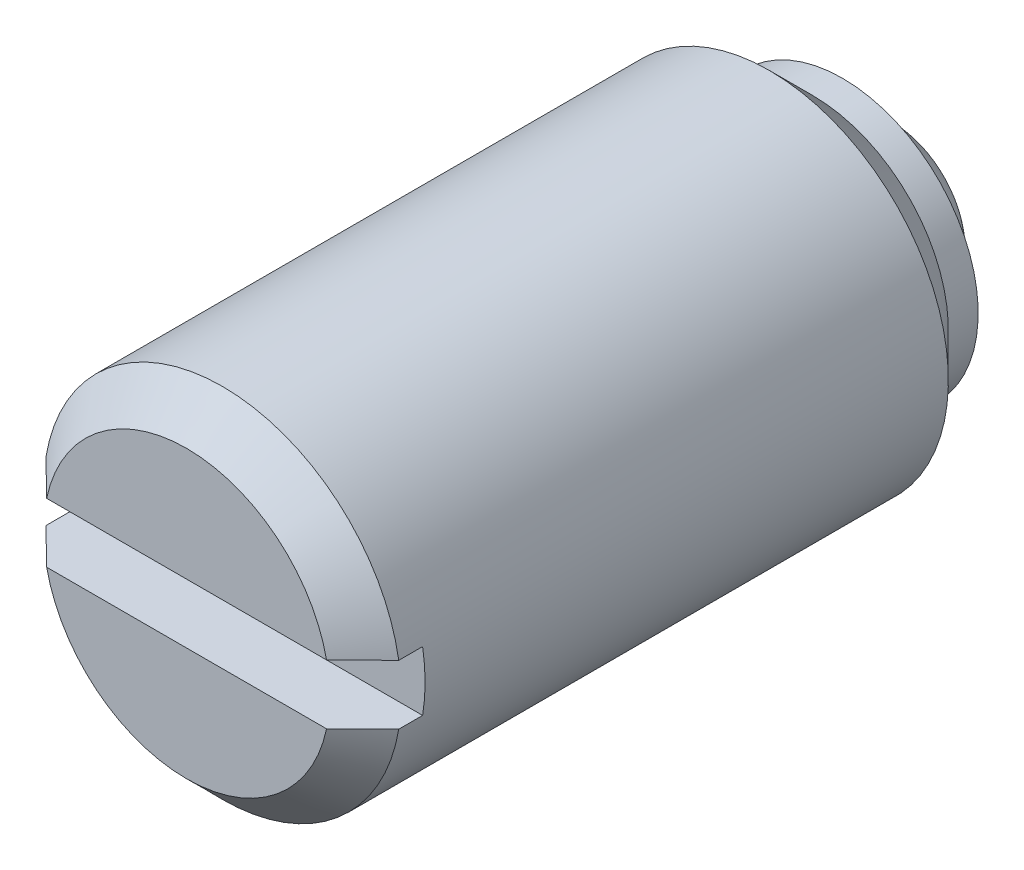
ISO-10303-21;
HEADER;
FILE_DESCRIPTION(('STEP AP214'),'2;1');
FILE_NAME('part.step','',(''),(''),'','','');
FILE_SCHEMA(('AUTOMOTIVE_DESIGN { 1 0 10303 214 1 1 1 1 }'));
ENDSEC;
DATA;
#1=APPLICATION_CONTEXT('core data for automotive mechanical design processes');
#2=APPLICATION_PROTOCOL_DEFINITION('international standard','automotive_design',2000,#1);
#3=PRODUCT_CONTEXT('',#1,'mechanical');
#4=PRODUCT('Part','Part','',(#3));
#5=PRODUCT_RELATED_PRODUCT_CATEGORY('part','',(#4));
#6=PRODUCT_DEFINITION_FORMATION('','',#4);
#7=PRODUCT_DEFINITION_CONTEXT('part definition',#1,'design');
#8=PRODUCT_DEFINITION('design','',#6,#7);
#9=PRODUCT_DEFINITION_SHAPE('','',#8);
#10=(LENGTH_UNIT() NAMED_UNIT(*) SI_UNIT(.MILLI.,.METRE.));
#11=(NAMED_UNIT(*) PLANE_ANGLE_UNIT() SI_UNIT($,.RADIAN.));
#12=(NAMED_UNIT(*) SI_UNIT($,.STERADIAN.) SOLID_ANGLE_UNIT());
#13=UNCERTAINTY_MEASURE_WITH_UNIT(LENGTH_MEASURE(1.E-05),#10,'distance_accuracy_value','');
#14=(GEOMETRIC_REPRESENTATION_CONTEXT(3) GLOBAL_UNCERTAINTY_ASSIGNED_CONTEXT((#13)) GLOBAL_UNIT_ASSIGNED_CONTEXT((#10,
#11,#12)) REPRESENTATION_CONTEXT('',''));
#15=CARTESIAN_POINT('',(0.,0.,0.));
#16=DIRECTION('',(0.,0.,1.));
#17=DIRECTION('',(1.,0.,0.));
#18=AXIS2_PLACEMENT_3D('',#15,#16,#17);
#19=CARTESIAN_POINT('',(0.,6.,24.5));
#20=DIRECTION('',(0.,0.,1.));
#21=DIRECTION('',(1.,0.,0.));
#22=AXIS2_PLACEMENT_3D('',#19,#20,#21);
#23=PLANE('',#22);
#24=CARTESIAN_POINT('',(0.,0.,24.5));
#25=DIRECTION('',(0.,0.,-1.));
#26=DIRECTION('',(0.,1.,0.));
#27=AXIS2_PLACEMENT_3D('',#24,#25,#26);
#28=CIRCLE('',#27,4.8);
#29=CARTESIAN_POINT('',(-4.6946778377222,1.,24.5));
#30=VERTEX_POINT('',#29);
#31=CARTESIAN_POINT('',(4.6946778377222,1.,24.5));
#32=VERTEX_POINT('',#31);
#33=EDGE_CURVE('E35',#30,#32,#28,.T.);
#34=ORIENTED_EDGE('',*,*,#33,.F.);
#35=DIRECTION('',(1.,0.,0.));
#36=VECTOR('',#35,1.);
#37=CARTESIAN_POINT('',(-5.91607978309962,1.,24.5));
#38=LINE('',#37,#36);
#39=EDGE_CURVE('E124',#30,#32,#38,.T.);
#40=ORIENTED_EDGE('',*,*,#39,.T.);
#41=EDGE_LOOP('',(#34,#40));
#42=FACE_BOUND('',#41,.T.);
#43=ADVANCED_FACE('F14',(#42),#23,.T.);
#44=CARTESIAN_POINT('',(0.,0.,-5.5));
#45=DIRECTION('',(0.,0.,-1.));
#46=DIRECTION('',(-1.,0.,0.));
#47=AXIS2_PLACEMENT_3D('',#44,#45,#46);
#48=CYLINDRICAL_SURFACE('',#47,6.);
#49=CARTESIAN_POINT('',(0.,0.,23.3));
#50=DIRECTION('',(0.,0.,-1.));
#51=DIRECTION('',(0.,1.,0.));
#52=AXIS2_PLACEMENT_3D('',#49,#50,#51);
#53=CIRCLE('',#52,6.);
#54=CARTESIAN_POINT('',(5.91607978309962,-1.,23.3));
#55=VERTEX_POINT('',#54);
#56=CARTESIAN_POINT('',(-5.91607978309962,-1.,23.3));
#57=VERTEX_POINT('',#56);
#58=EDGE_CURVE('E43',#55,#57,#53,.T.);
#59=ORIENTED_EDGE('',*,*,#58,.T.);
#60=DIRECTION('',(0.,0.,1.));
#61=VECTOR('',#60,1.);
#62=CARTESIAN_POINT('',(-5.91607978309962,-1.,22.5));
#63=LINE('',#62,#61);
#64=CARTESIAN_POINT('',(-5.91607978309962,-1.,22.5));
#65=VERTEX_POINT('',#64);
#66=EDGE_CURVE('E101',#65,#57,#63,.T.);
#67=ORIENTED_EDGE('',*,*,#66,.F.);
#68=CARTESIAN_POINT('',(0.,0.,22.5));
#69=DIRECTION('',(0.,0.,1.));
#70=DIRECTION('',(1.,0.,0.));
#71=AXIS2_PLACEMENT_3D('',#68,#69,#70);
#72=CIRCLE('',#71,6.);
#73=CARTESIAN_POINT('',(-5.91607978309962,1.,22.5));
#74=VERTEX_POINT('',#73);
#75=EDGE_CURVE('E121',#74,#65,#72,.T.);
#76=ORIENTED_EDGE('',*,*,#75,.F.);
#77=DIRECTION('',(0.,0.,1.));
#78=VECTOR('',#77,1.);
#79=CARTESIAN_POINT('',(-5.91607978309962,1.,22.5));
#80=LINE('',#79,#78);
#81=CARTESIAN_POINT('',(-5.91607978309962,1.,23.3));
#82=VERTEX_POINT('',#81);
#83=EDGE_CURVE('E90',#74,#82,#80,.T.);
#84=ORIENTED_EDGE('',*,*,#83,.T.);
#85=CARTESIAN_POINT('',(5.91607978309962,1.,23.3));
#86=VERTEX_POINT('',#85);
#87=EDGE_CURVE('E73',#82,#86,#53,.T.);
#88=ORIENTED_EDGE('',*,*,#87,.T.);
#89=DIRECTION('',(0.,0.,1.));
#90=VECTOR('',#89,1.);
#91=CARTESIAN_POINT('',(5.91607978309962,1.,22.5));
#92=LINE('',#91,#90);
#93=CARTESIAN_POINT('',(5.91607978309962,1.,22.5));
#94=VERTEX_POINT('',#93);
#95=EDGE_CURVE('E88',#94,#86,#92,.T.);
#96=ORIENTED_EDGE('',*,*,#95,.F.);
#97=CARTESIAN_POINT('',(5.91607978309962,-1.,22.5));
#98=VERTEX_POINT('',#97);
#99=EDGE_CURVE('E117',#98,#94,#72,.T.);
#100=ORIENTED_EDGE('',*,*,#99,.F.);
#101=DIRECTION('',(0.,0.,1.));
#102=VECTOR('',#101,1.);
#103=CARTESIAN_POINT('',(5.91607978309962,-1.,22.5));
#104=LINE('',#103,#102);
#105=EDGE_CURVE('E96',#98,#55,#104,.T.);
#106=ORIENTED_EDGE('',*,*,#105,.T.);
#107=EDGE_LOOP('',(#59,#67,#76,#84,#88,#96,#100,#106));
#108=FACE_BOUND('',#107,.T.);
#109=CARTESIAN_POINT('',(0.,0.,4.95));
#110=DIRECTION('',(0.,0.,-1.));
#111=DIRECTION('',(0.,1.,0.));
#112=AXIS2_PLACEMENT_3D('',#109,#110,#111);
#113=CIRCLE('',#112,6.);
#114=CARTESIAN_POINT('',(0.,6.,4.95));
#115=VERTEX_POINT('',#114);
#116=EDGE_CURVE('E135',#115,#115,#113,.T.);
#117=ORIENTED_EDGE('',*,*,#116,.F.);
#118=EDGE_LOOP('',(#117));
#119=FACE_BOUND('',#118,.T.);
#120=ADVANCED_FACE('F85',(#108,#119),#48,.T.);
#121=CARTESIAN_POINT('',(4.6946778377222,-1.,24.5));
#122=VERTEX_POINT('',#121);
#123=CARTESIAN_POINT('',(-4.6946778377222,-1.,24.5));
#124=VERTEX_POINT('',#123);
#125=EDGE_CURVE('E80',#122,#124,#28,.T.);
#126=ORIENTED_EDGE('',*,*,#125,.F.);
#127=DIRECTION('',(1.,0.,0.));
#128=VECTOR('',#127,1.);
#129=CARTESIAN_POINT('',(-5.91607978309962,-1.,24.5));
#130=LINE('',#129,#128);
#131=EDGE_CURVE('E114',#124,#122,#130,.T.);
#132=ORIENTED_EDGE('',*,*,#131,.F.);
#133=EDGE_LOOP('',(#126,#132));
#134=FACE_BOUND('',#133,.T.);
#135=ADVANCED_FACE('F167',(#134),#23,.T.);
#136=CARTESIAN_POINT('',(-5.91607978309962,1.,22.5));
#137=DIRECTION('',(0.,-1.,0.));
#138=DIRECTION('',(1.,0.,0.));
#139=AXIS2_PLACEMENT_3D('',#136,#137,#138);
#140=PLANE('',#139);
#141=CARTESIAN_POINT('',(-13.0519927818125,1.,16.2097549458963));
#142=CARTESIAN_POINT('',(-12.58929661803,1.,16.671087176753));
#143=CARTESIAN_POINT('',(-12.1265400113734,1.,17.1323588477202));
#144=CARTESIAN_POINT('',(-11.2008062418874,1.,18.0547155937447));
#145=CARTESIAN_POINT('',(-10.7378290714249,1.,18.5158006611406));
#146=CARTESIAN_POINT('',(-9.81116624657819,1.,19.4381050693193));
#147=CARTESIAN_POINT('',(-9.34748033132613,1.,19.8993241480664));
#148=CARTESIAN_POINT('',(-8.41968269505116,1.,20.8212999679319));
#149=CARTESIAN_POINT('',(-7.95557099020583,1.,21.2820567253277));
#150=CARTESIAN_POINT('',(-7.04752197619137,1.,22.1821315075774));
#151=CARTESIAN_POINT('',(-6.60361637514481,1.,22.6214814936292));
#152=CARTESIAN_POINT('',(-5.93684301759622,1.,23.2796291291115));
#153=CARTESIAN_POINT('',(-5.71442037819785,1.,23.4988775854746));
#154=CARTESIAN_POINT('',(-5.26915444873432,1.,23.936942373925));
#155=CARTESIAN_POINT('',(-5.04631116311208,1.,24.1557587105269));
#156=CARTESIAN_POINT('',(-4.60013621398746,1.,24.5926451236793));
#157=CARTESIAN_POINT('',(-4.37680489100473,1.,24.8107155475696));
#158=CARTESIAN_POINT('',(-3.92918846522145,1.,25.2458936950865));
#159=CARTESIAN_POINT('',(-3.70490332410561,1.,25.4630013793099));
#160=CARTESIAN_POINT('',(-3.25484186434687,1.,25.895586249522));
#161=CARTESIAN_POINT('',(-3.02906584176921,1.,26.1110637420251));
#162=CARTESIAN_POINT('',(-2.68827197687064,1.,26.4320059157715));
#163=CARTESIAN_POINT('',(-2.57432277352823,1.,26.5386042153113));
#164=CARTESIAN_POINT('',(-2.34539441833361,1.,26.7506879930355));
#165=CARTESIAN_POINT('',(-2.23041529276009,1.,26.8561734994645));
#166=CARTESIAN_POINT('',(-2.0825088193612,1.,26.9898791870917));
#167=CARTESIAN_POINT('',(-2.05029097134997,1.,27.0188844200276));
#168=CARTESIAN_POINT('',(-1.98571879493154,1.,27.0767427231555));
#169=CARTESIAN_POINT('',(-1.95336446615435,1.,27.1055957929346));
#170=CARTESIAN_POINT('',(-1.85606527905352,1.,27.1919016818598));
#171=CARTESIAN_POINT('',(-1.79089022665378,1.,27.2490957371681));
#172=CARTESIAN_POINT('',(-1.65925975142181,1.,27.3629806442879));
#173=CARTESIAN_POINT('',(-1.5927984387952,1.,27.4196647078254));
#174=CARTESIAN_POINT('',(-1.45881178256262,1.,27.5317294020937));
#175=CARTESIAN_POINT('',(-1.39128672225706,1.,27.5871103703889));
#176=CARTESIAN_POINT('',(-1.25418064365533,1.,27.6964913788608));
#177=CARTESIAN_POINT('',(-1.1845870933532,1.,27.7504758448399));
#178=CARTESIAN_POINT('',(-1.04331235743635,1.,27.8556076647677));
#179=CARTESIAN_POINT('',(-0.971631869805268,1.,27.9067559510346));
#180=CARTESIAN_POINT('',(-0.825655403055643,1.,28.0043331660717));
#181=CARTESIAN_POINT('',(-0.751377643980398,1.,28.0507885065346));
#182=CARTESIAN_POINT('',(-0.636883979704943,1.,28.1148257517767));
#183=CARTESIAN_POINT('',(-0.598246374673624,1.,28.135213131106));
#184=CARTESIAN_POINT('',(-0.519768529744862,1.,28.1735083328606));
#185=CARTESIAN_POINT('',(-0.479929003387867,1.,28.1914175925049));
#186=CARTESIAN_POINT('',(-0.40897634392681,1.,28.219960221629));
#187=CARTESIAN_POINT('',(-0.378147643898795,1.,28.231296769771));
#188=CARTESIAN_POINT('',(-0.315750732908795,1.,28.2517490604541));
#189=CARTESIAN_POINT('',(-0.284182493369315,1.,28.2608647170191));
#190=CARTESIAN_POINT('',(-0.220522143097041,1.,28.2764363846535));
#191=CARTESIAN_POINT('',(-0.188432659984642,1.,28.2829029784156));
#192=CARTESIAN_POINT('',(-0.12379850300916,1.,28.2928716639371));
#193=CARTESIAN_POINT('',(-0.0912539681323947,1.,28.2963746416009));
#194=CARTESIAN_POINT('',(-0.0256780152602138,1.,28.3002100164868));
#195=CARTESIAN_POINT('',(0.00735514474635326,1.,28.3005134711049));
#196=CARTESIAN_POINT('',(0.073282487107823,0.999999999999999,28.297861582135));
#197=CARTESIAN_POINT('',(0.106176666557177,1.,28.2949061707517));
#198=CARTESIAN_POINT('',(0.204387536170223,1.,28.2813804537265));
#199=CARTESIAN_POINT('',(0.269086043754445,1.,28.2661432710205));
#200=CARTESIAN_POINT('',(0.380661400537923,1.,28.2310021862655));
#201=CARTESIAN_POINT('',(0.428188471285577,1.,28.2130030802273));
#202=CARTESIAN_POINT('',(0.521535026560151,1.,28.1729565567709));
#203=CARTESIAN_POINT('',(0.567353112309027,1.,28.1509059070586));
#204=CARTESIAN_POINT('',(0.657633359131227,1.,28.1037600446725));
#205=CARTESIAN_POINT('',(0.702088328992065,1.,28.0786513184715));
#206=CARTESIAN_POINT('',(0.789674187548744,1.,28.0262824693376));
#207=CARTESIAN_POINT('',(0.832805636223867,1.,27.9990232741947));
#208=CARTESIAN_POINT('',(0.9263561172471,1.,27.937405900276));
#209=CARTESIAN_POINT('',(0.976546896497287,1.,27.9027033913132));
#210=CARTESIAN_POINT('',(1.0757523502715,0.999999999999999,27.8316497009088));
#211=CARTESIAN_POINT('',(1.12476679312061,1.,27.7952981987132));
#212=CARTESIAN_POINT('',(1.27050577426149,1.,27.6843979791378));
#213=CARTESIAN_POINT('',(1.36585709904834,1.,27.6080507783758));
#214=CARTESIAN_POINT('',(1.55447636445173,1.,27.4524086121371));
#215=CARTESIAN_POINT('',(1.64773867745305,1.,27.3731069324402));
#216=CARTESIAN_POINT('',(1.83267806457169,1.,27.2127554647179));
#217=CARTESIAN_POINT('',(1.92435576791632,1.,27.1317064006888));
#218=CARTESIAN_POINT('',(2.10680759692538,1.,26.9682626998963));
#219=CARTESIAN_POINT('',(2.19757971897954,1.,26.8858658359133));
#220=CARTESIAN_POINT('',(2.37835700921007,1.,26.7202181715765));
#221=CARTESIAN_POINT('',(2.46836209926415,1.,26.6369672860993));
#222=CARTESIAN_POINT('',(2.64765920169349,1.,26.4699758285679));
#223=CARTESIAN_POINT('',(2.73695209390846,1.,26.3862361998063));
#224=CARTESIAN_POINT('',(2.91509603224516,1.,26.2182948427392));
#225=CARTESIAN_POINT('',(3.00394709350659,1.,26.1340931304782));
#226=CARTESIAN_POINT('',(3.26837443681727,1.,25.8824978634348));
#227=CARTESIAN_POINT('',(3.44345709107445,1.,25.7145857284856));
#228=CARTESIAN_POINT('',(3.79277465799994,0.999999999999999,25.3778813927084));
#229=CARTESIAN_POINT('',(3.96700956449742,0.999999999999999,25.2090891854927));
#230=CARTESIAN_POINT('',(4.48887363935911,0.999999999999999,24.7018269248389));
#231=CARTESIAN_POINT('',(4.83565144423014,0.999999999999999,24.3624815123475));
#232=CARTESIAN_POINT('',(5.52825371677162,0.999999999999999,23.6823998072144));
#233=CARTESIAN_POINT('',(5.87407747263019,0.999999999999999,23.3416627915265));
#234=CARTESIAN_POINT('',(6.56501859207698,0.999999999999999,22.6594836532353));
#235=CARTESIAN_POINT('',(6.91013596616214,0.999999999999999,22.3180415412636));
#236=CARTESIAN_POINT('',(7.59913569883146,0.999999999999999,21.6354925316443));
#237=CARTESIAN_POINT('',(7.94301907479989,0.999999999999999,21.294386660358));
#238=CARTESIAN_POINT('',(8.63048581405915,0.999999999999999,20.6118700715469));
#239=CARTESIAN_POINT('',(8.97406917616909,0.999999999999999,20.2704593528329));
#240=CARTESIAN_POINT('',(10.0043993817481,1.,19.2460173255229));
#241=CARTESIAN_POINT('',(10.6908326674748,1.,18.5626706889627));
#242=CARTESIAN_POINT('',(11.5166056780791,1.,17.7400662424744));
#243=CARTESIAN_POINT('',(11.6561624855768,0.999999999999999,17.6010261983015));
#244=CARTESIAN_POINT('',(11.9352613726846,0.999999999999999,17.3229251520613));
#245=CARTESIAN_POINT('',(12.0748034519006,0.999999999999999,17.1838641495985));
#246=CARTESIAN_POINT('',(12.353963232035,0.999999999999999,16.9056352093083));
#247=CARTESIAN_POINT('',(12.4935809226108,0.999999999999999,16.7664672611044));
#248=CARTESIAN_POINT('',(12.7727988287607,0.999999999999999,16.4881200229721));
#249=CARTESIAN_POINT('',(12.9123990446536,0.999999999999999,16.3489407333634));
#250=CARTESIAN_POINT('',(13.0519927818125,1.,16.2097549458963));
#251=B_SPLINE_CURVE_WITH_KNOTS('',3,(#141,#142,#143,#144,#145,#146,#147,#148,#149,#150,#151,
#152,#153,#154,#155,#156,#157,#158,#159,#160,#161,#162,#163,#164,#165,#166,#167,#168,#169,#170,
#171,#172,#173,#174,#175,#176,#177,#178,#179,#180,#181,#182,#183,#184,#185,#186,#187,#188,#189,
#190,#191,#192,#193,#194,#195,#196,#197,#198,#199,#200,#201,#202,#203,#204,#205,#206,#207,#208,
#209,#210,#211,#212,#213,#214,#215,#216,#217,#218,#219,#220,#221,#222,#223,#224,#225,#226,#227,
#228,#229,#230,#231,#232,#233,#234,#235,#236,#237,#238,#239,#240,#241,#242,#243,#244,#245,#246,
#247,#248,#249,#250),.UNSPECIFIED.,.F.,.F.,(4,2,2,2,2,2,2,2,2,2,2,2,2,2,2,2,2,2,2,2,2,2,2,2,2,2,
2,2,2,2,2,2,2,2,2,2,2,2,2,2,2,2,2,2,2,2,2,2,2,2,2,2,2,2,4),(0.,1.96016242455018,
3.92039849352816,5.88242503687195,7.84437988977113,9.71807133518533,10.6550209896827,
11.5919608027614,12.5283795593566,13.4648362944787,14.4011123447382,14.8692200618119,
15.337315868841,15.4673679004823,15.597420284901,15.8575493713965,16.1195903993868,
16.3815627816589,16.6457432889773,16.909836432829,17.1723490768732,17.3033461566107,
17.4342669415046,17.5327396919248,17.6312162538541,17.7292954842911,17.8273453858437,
17.9262814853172,18.0252196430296,18.2235285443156,18.3757961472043,18.5281857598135,
18.6812750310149,18.8342986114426,19.0173097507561,19.2003566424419,19.5667006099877,
19.9339350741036,20.3010201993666,20.668789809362,21.0365964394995,21.4038407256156,
21.771072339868,22.4988274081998,23.2265877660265,24.6821530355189,26.138607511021,
27.5950401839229,29.0481335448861,30.5012325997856,33.4069814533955,33.9979756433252,
34.5889829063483,35.1803773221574,35.7717586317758),.UNSPECIFIED.);
#252=EDGE_CURVE('E79',#82,#30,#251,.T.);
#253=ORIENTED_EDGE('',*,*,#252,.F.);
#254=ORIENTED_EDGE('',*,*,#83,.F.);
#255=DIRECTION('',(1.,0.,0.));
#256=VECTOR('',#255,1.);
#257=CARTESIAN_POINT('',(-5.91607978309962,1.,22.5));
#258=LINE('',#257,#256);
#259=EDGE_CURVE('E95',#74,#94,#258,.T.);
#260=ORIENTED_EDGE('',*,*,#259,.T.);
#261=ORIENTED_EDGE('',*,*,#95,.T.);
#262=EDGE_CURVE('E70',#32,#86,#251,.T.);
#263=ORIENTED_EDGE('',*,*,#262,.F.);
#264=ORIENTED_EDGE('',*,*,#39,.F.);
#265=EDGE_LOOP('',(#253,#254,#260,#261,#263,#264));
#266=FACE_BOUND('',#265,.T.);
#267=ADVANCED_FACE('F93',(#266),#140,.T.);
#268=CARTESIAN_POINT('',(-5.91607978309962,-1.,22.5));
#269=DIRECTION('',(0.,-1.,0.));
#270=DIRECTION('',(1.,0.,0.));
#271=AXIS2_PLACEMENT_3D('',#268,#269,#270);
#272=PLANE('',#271);
#273=ORIENTED_EDGE('',*,*,#66,.T.);
#274=CARTESIAN_POINT('',(-13.0519927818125,-1.,16.2097549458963));
#275=CARTESIAN_POINT('',(-12.58929661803,-1.,16.671087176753));
#276=CARTESIAN_POINT('',(-12.1265400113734,-1.,17.1323588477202));
#277=CARTESIAN_POINT('',(-11.2008062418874,-1.,18.0547155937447));
#278=CARTESIAN_POINT('',(-10.7378290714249,-1.,18.5158006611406));
#279=CARTESIAN_POINT('',(-9.81116624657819,-1.,19.4381050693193));
#280=CARTESIAN_POINT('',(-9.34748033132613,-1.,19.8993241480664));
#281=CARTESIAN_POINT('',(-8.41968269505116,-1.,20.8212999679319));
#282=CARTESIAN_POINT('',(-7.95557099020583,-1.,21.2820567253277));
#283=CARTESIAN_POINT('',(-7.04752197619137,-1.,22.1821315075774));
#284=CARTESIAN_POINT('',(-6.60361637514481,-1.,22.6214814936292));
#285=CARTESIAN_POINT('',(-5.93684301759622,-1.,23.2796291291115));
#286=CARTESIAN_POINT('',(-5.71442037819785,-1.,23.4988775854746));
#287=CARTESIAN_POINT('',(-5.26915444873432,-1.,23.936942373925));
#288=CARTESIAN_POINT('',(-5.04631116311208,-1.,24.1557587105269));
#289=CARTESIAN_POINT('',(-4.60013621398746,-1.,24.5926451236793));
#290=CARTESIAN_POINT('',(-4.37680489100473,-1.,24.8107155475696));
#291=CARTESIAN_POINT('',(-3.92918846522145,-1.,25.2458936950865));
#292=CARTESIAN_POINT('',(-3.70490332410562,-1.,25.4630013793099));
#293=CARTESIAN_POINT('',(-3.25484186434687,-1.,25.895586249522));
#294=CARTESIAN_POINT('',(-3.02906584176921,-1.,26.1110637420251));
#295=CARTESIAN_POINT('',(-2.68827197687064,-1.,26.4320059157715));
#296=CARTESIAN_POINT('',(-2.57432277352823,-1.,26.5386042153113));
#297=CARTESIAN_POINT('',(-2.34539441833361,-1.,26.7506879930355));
#298=CARTESIAN_POINT('',(-2.23041529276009,-1.,26.8561734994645));
#299=CARTESIAN_POINT('',(-2.0825088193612,-1.,26.9898791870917));
#300=CARTESIAN_POINT('',(-2.05029097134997,-1.,27.0188844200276));
#301=CARTESIAN_POINT('',(-1.98571879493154,-1.,27.0767427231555));
#302=CARTESIAN_POINT('',(-1.95336446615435,-1.,27.1055957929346));
#303=CARTESIAN_POINT('',(-1.85606527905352,-1.,27.1919016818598));
#304=CARTESIAN_POINT('',(-1.79089022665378,-1.,27.2490957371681));
#305=CARTESIAN_POINT('',(-1.65925975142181,-1.,27.3629806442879));
#306=CARTESIAN_POINT('',(-1.5927984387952,-1.,27.4196647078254));
#307=CARTESIAN_POINT('',(-1.45881178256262,-1.,27.5317294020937));
#308=CARTESIAN_POINT('',(-1.39128672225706,-1.,27.5871103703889));
#309=CARTESIAN_POINT('',(-1.25418064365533,-1.,27.6964913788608));
#310=CARTESIAN_POINT('',(-1.1845870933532,-1.,27.7504758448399));
#311=CARTESIAN_POINT('',(-1.04331235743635,-1.,27.8556076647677));
#312=CARTESIAN_POINT('',(-0.971631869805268,-1.,27.9067559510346));
#313=CARTESIAN_POINT('',(-0.825655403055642,-1.,28.0043331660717));
#314=CARTESIAN_POINT('',(-0.751377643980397,-1.,28.0507885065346));
#315=CARTESIAN_POINT('',(-0.636883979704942,-1.,28.1148257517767));
#316=CARTESIAN_POINT('',(-0.598246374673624,-1.,28.135213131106));
#317=CARTESIAN_POINT('',(-0.519768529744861,-1.,28.1735083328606));
#318=CARTESIAN_POINT('',(-0.479929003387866,-1.,28.1914175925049));
#319=CARTESIAN_POINT('',(-0.408976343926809,-1.,28.219960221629));
#320=CARTESIAN_POINT('',(-0.378147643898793,-1.,28.231296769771));
#321=CARTESIAN_POINT('',(-0.315750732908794,-1.,28.2517490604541));
#322=CARTESIAN_POINT('',(-0.284182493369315,-1.,28.2608647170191));
#323=CARTESIAN_POINT('',(-0.22052214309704,-1.,28.2764363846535));
#324=CARTESIAN_POINT('',(-0.188432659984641,-1.,28.2829029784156));
#325=CARTESIAN_POINT('',(-0.123798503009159,-1.,28.2928716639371));
#326=CARTESIAN_POINT('',(-0.0912539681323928,-1.,28.2963746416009));
#327=CARTESIAN_POINT('',(-0.0256780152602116,-1.,28.3002100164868));
#328=CARTESIAN_POINT('',(0.00735514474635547,-1.,28.3005134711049));
#329=CARTESIAN_POINT('',(0.073282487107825,-1.,28.297861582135));
#330=CARTESIAN_POINT('',(0.106176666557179,-1.,28.2949061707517));
#331=CARTESIAN_POINT('',(0.204387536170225,-1.,28.2813804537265));
#332=CARTESIAN_POINT('',(0.269086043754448,-1.,28.2661432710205));
#333=CARTESIAN_POINT('',(0.380661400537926,-1.,28.2310021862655));
#334=CARTESIAN_POINT('',(0.42818847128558,-1.,28.2130030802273));
#335=CARTESIAN_POINT('',(0.521535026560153,-1.,28.1729565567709));
#336=CARTESIAN_POINT('',(0.567353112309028,-1.,28.1509059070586));
#337=CARTESIAN_POINT('',(0.657633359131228,-1.,28.1037600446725));
#338=CARTESIAN_POINT('',(0.702088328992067,-1.,28.0786513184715));
#339=CARTESIAN_POINT('',(0.789674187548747,-1.,28.0262824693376));
#340=CARTESIAN_POINT('',(0.83280563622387,-1.,27.9990232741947));
#341=CARTESIAN_POINT('',(0.926356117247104,-1.,27.937405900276));
#342=CARTESIAN_POINT('',(0.976546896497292,-1.,27.9027033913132));
#343=CARTESIAN_POINT('',(1.0757523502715,-1.,27.8316497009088));
#344=CARTESIAN_POINT('',(1.12476679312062,-1.,27.7952981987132));
#345=CARTESIAN_POINT('',(1.2705057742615,-1.,27.6843979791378));
#346=CARTESIAN_POINT('',(1.36585709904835,-1.,27.6080507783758));
#347=CARTESIAN_POINT('',(1.55447636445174,-1.,27.4524086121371));
#348=CARTESIAN_POINT('',(1.64773867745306,-1.,27.3731069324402));
#349=CARTESIAN_POINT('',(1.83267806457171,-1.,27.2127554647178));
#350=CARTESIAN_POINT('',(1.92435576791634,-1.,27.1317064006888));
#351=CARTESIAN_POINT('',(2.1068075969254,-1.,26.9682626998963));
#352=CARTESIAN_POINT('',(2.19757971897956,-1.,26.8858658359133));
#353=CARTESIAN_POINT('',(2.37835700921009,-1.,26.7202181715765));
#354=CARTESIAN_POINT('',(2.46836209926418,-1.,26.6369672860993));
#355=CARTESIAN_POINT('',(2.64765920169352,-1.,26.4699758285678));
#356=CARTESIAN_POINT('',(2.73695209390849,-1.,26.3862361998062));
#357=CARTESIAN_POINT('',(2.91509603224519,-1.,26.2182948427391));
#358=CARTESIAN_POINT('',(3.00394709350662,-1.,26.1340931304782));
#359=CARTESIAN_POINT('',(3.26837443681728,-1.,25.8824978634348));
#360=CARTESIAN_POINT('',(3.44345709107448,-1.,25.7145857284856));
#361=CARTESIAN_POINT('',(3.79277465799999,-1.,25.3778813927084));
#362=CARTESIAN_POINT('',(3.96700956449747,-1.,25.2090891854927));
#363=CARTESIAN_POINT('',(4.48887363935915,-1.,24.7018269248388));
#364=CARTESIAN_POINT('',(4.83565144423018,-1.,24.3624815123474));
#365=CARTESIAN_POINT('',(5.52825371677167,-1.,23.6823998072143));
#366=CARTESIAN_POINT('',(5.87407747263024,-1.,23.3416627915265));
#367=CARTESIAN_POINT('',(6.56501859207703,-1.,22.6594836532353));
#368=CARTESIAN_POINT('',(6.91013596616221,-1.,22.3180415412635));
#369=CARTESIAN_POINT('',(7.59913569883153,-1.,21.6354925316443));
#370=CARTESIAN_POINT('',(7.94301907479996,-1.,21.2943866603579));
#371=CARTESIAN_POINT('',(8.63048581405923,-1.,20.6118700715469));
#372=CARTESIAN_POINT('',(8.97406917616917,-1.,20.2704593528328));
#373=CARTESIAN_POINT('',(10.0043993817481,-1.,19.2460173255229));
#374=CARTESIAN_POINT('',(10.6908326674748,-0.999999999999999,18.5626706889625));
#375=CARTESIAN_POINT('',(11.5166056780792,-1.,17.7400662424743));
#376=CARTESIAN_POINT('',(11.6561624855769,-1.,17.6010261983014));
#377=CARTESIAN_POINT('',(11.9352613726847,-1.,17.3229251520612));
#378=CARTESIAN_POINT('',(12.0748034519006,-1.,17.1838641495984));
#379=CARTESIAN_POINT('',(12.353963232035,-1.,16.9056352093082));
#380=CARTESIAN_POINT('',(12.4935809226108,-1.,16.7664672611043));
#381=CARTESIAN_POINT('',(12.7727988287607,-1.,16.4881200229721));
#382=CARTESIAN_POINT('',(12.9123990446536,-1.,16.3489407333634));
#383=CARTESIAN_POINT('',(13.0519927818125,-1.,16.2097549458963));
#384=B_SPLINE_CURVE_WITH_KNOTS('',3,(#274,#275,#276,#277,#278,#279,#280,#281,#282,#283,#284,
#285,#286,#287,#288,#289,#290,#291,#292,#293,#294,#295,#296,#297,#298,#299,#300,#301,#302,#303,
#304,#305,#306,#307,#308,#309,#310,#311,#312,#313,#314,#315,#316,#317,#318,#319,#320,#321,#322,
#323,#324,#325,#326,#327,#328,#329,#330,#331,#332,#333,#334,#335,#336,#337,#338,#339,#340,#341,
#342,#343,#344,#345,#346,#347,#348,#349,#350,#351,#352,#353,#354,#355,#356,#357,#358,#359,#360,
#361,#362,#363,#364,#365,#366,#367,#368,#369,#370,#371,#372,#373,#374,#375,#376,#377,#378,#379,
#380,#381,#382,#383),.UNSPECIFIED.,.F.,.F.,(4,2,2,2,2,2,2,2,2,2,2,2,2,2,2,2,2,2,2,2,2,2,2,2,2,2,
2,2,2,2,2,2,2,2,2,2,2,2,2,2,2,2,2,2,2,2,2,2,2,2,2,2,2,2,4),(0.,1.96016242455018,
3.92039849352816,5.88242503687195,7.84437988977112,9.71807133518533,10.6550209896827,
11.5919608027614,12.5283795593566,13.4648362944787,14.4011123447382,14.8692200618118,
15.337315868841,15.4673679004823,15.597420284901,15.8575493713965,16.1195903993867,
16.3815627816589,16.6457432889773,16.9098364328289,17.1723490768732,17.3033461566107,
17.4342669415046,17.5327396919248,17.6312162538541,17.7292954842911,17.8273453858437,
17.9262814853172,18.0252196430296,18.2235285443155,18.3757961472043,18.5281857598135,
18.6812750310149,18.8342986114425,19.017309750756,19.2003566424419,19.5667006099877,
19.9339350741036,20.3010201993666,20.668789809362,21.0365964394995,21.4038407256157,
21.7710723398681,22.4988274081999,23.2265877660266,24.6821530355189,26.1386075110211,
27.5950401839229,29.0481335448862,30.5012325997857,33.4069814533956,33.9979756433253,
34.5889829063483,35.1803773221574,35.7717586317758),.UNSPECIFIED.);
#385=EDGE_CURVE('E9',#57,#124,#384,.T.);
#386=ORIENTED_EDGE('',*,*,#385,.T.);
#387=ORIENTED_EDGE('',*,*,#131,.T.);
#388=EDGE_CURVE('E18',#122,#55,#384,.T.);
#389=ORIENTED_EDGE('',*,*,#388,.T.);
#390=ORIENTED_EDGE('',*,*,#105,.F.);
#391=DIRECTION('',(1.,0.,0.));
#392=VECTOR('',#391,1.);
#393=CARTESIAN_POINT('',(-5.91607978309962,-1.,22.5));
#394=LINE('',#393,#392);
#395=EDGE_CURVE('E119',#65,#98,#394,.T.);
#396=ORIENTED_EDGE('',*,*,#395,.F.);
#397=EDGE_LOOP('',(#273,#386,#387,#389,#390,#396));
#398=FACE_BOUND('',#397,.T.);
#399=ADVANCED_FACE('F111',(#398),#272,.F.);
#400=CARTESIAN_POINT('',(0.,0.,22.5));
#401=DIRECTION('',(0.,0.,1.));
#402=DIRECTION('',(1.,0.,0.));
#403=AXIS2_PLACEMENT_3D('',#400,#401,#402);
#404=PLANE('',#403);
#405=ORIENTED_EDGE('',*,*,#75,.T.);
#406=ORIENTED_EDGE('',*,*,#395,.T.);
#407=ORIENTED_EDGE('',*,*,#99,.T.);
#408=ORIENTED_EDGE('',*,*,#259,.F.);
#409=EDGE_LOOP('',(#405,#406,#407,#408));
#410=FACE_BOUND('',#409,.T.);
#411=ADVANCED_FACE('F157',(#410),#404,.T.);
#412=CARTESIAN_POINT('',(0.,0.,-1.88825268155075));
#413=DIRECTION('',(0.,0.,-1.));
#414=DIRECTION('',(0.,1.,0.));
#415=AXIS2_PLACEMENT_3D('',#412,#413,#414);
#416=CYLINDRICAL_SURFACE('',#415,4.55);
#417=CARTESIAN_POINT('',(0.,0.,2.5));
#418=DIRECTION('',(0.,0.,-1.));
#419=DIRECTION('',(0.,1.,0.));
#420=AXIS2_PLACEMENT_3D('',#417,#418,#419);
#421=CIRCLE('',#420,4.55);
#422=CARTESIAN_POINT('',(0.,4.55,2.5));
#423=VERTEX_POINT('',#422);
#424=EDGE_CURVE('E127',#423,#423,#421,.T.);
#425=ORIENTED_EDGE('',*,*,#424,.F.);
#426=EDGE_LOOP('',(#425));
#427=FACE_BOUND('',#426,.T.);
#428=CARTESIAN_POINT('',(0.,0.,3.5));
#429=DIRECTION('',(0.,0.,-1.));
#430=DIRECTION('',(0.,1.,0.));
#431=AXIS2_PLACEMENT_3D('',#428,#429,#430);
#432=CIRCLE('',#431,4.55);
#433=CARTESIAN_POINT('',(0.,4.55,3.5));
#434=VERTEX_POINT('',#433);
#435=EDGE_CURVE('E132',#434,#434,#432,.T.);
#436=ORIENTED_EDGE('',*,*,#435,.T.);
#437=EDGE_LOOP('',(#436));
#438=FACE_BOUND('',#437,.T.);
#439=ADVANCED_FACE('F153',(#427,#438),#416,.T.);
#440=CARTESIAN_POINT('',(0.,0.,4.95));
#441=DIRECTION('',(0.,0.,1.));
#442=DIRECTION('',(0.,-1.,0.));
#443=AXIS2_PLACEMENT_3D('',#440,#441,#442);
#444=CONICAL_SURFACE('',#443,6.,0.785398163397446);
#445=ORIENTED_EDGE('',*,*,#435,.F.);
#446=EDGE_LOOP('',(#445));
#447=FACE_BOUND('',#446,.T.);
#448=ORIENTED_EDGE('',*,*,#116,.T.);
#449=EDGE_LOOP('',(#448));
#450=FACE_BOUND('',#449,.T.);
#451=ADVANCED_FACE('F149',(#447,#450),#444,.T.);
#452=CARTESIAN_POINT('',(0.,0.,4.));
#453=DIRECTION('',(-1.,0.,0.));
#454=DIRECTION('',(0.,0.,1.));
#455=AXIS2_PLACEMENT_3D('',#452,#453,#454);
#456=SPHERICAL_SURFACE('',#455,4.);
#457=CARTESIAN_POINT('',(0.,0.,4.));
#458=DIRECTION('',(0.,0.,-1.));
#459=DIRECTION('',(-1.,0.,0.));
#460=AXIS2_PLACEMENT_3D('',#457,#458,#459);
#461=SPHERICAL_SURFACE('',#460,4.);
#462=CARTESIAN_POINT('',(0.,0.,2.5));
#463=DIRECTION('',(0.,0.,-1.));
#464=DIRECTION('',(-1.,0.,0.));
#465=AXIS2_PLACEMENT_3D('',#462,#463,#464);
#466=CIRCLE('',#465,3.70809924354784);
#467=CARTESIAN_POINT('',(-3.70809924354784,0.,2.5));
#468=VERTEX_POINT('',#467);
#469=EDGE_CURVE('E98',#468,#468,#466,.T.);
#470=ORIENTED_EDGE('',*,*,#469,.T.);
#471=EDGE_LOOP('',(#470));
#472=FACE_BOUND('',#471,.T.);
#473=ADVANCED_FACE('F16',(#472),#461,.T.);
#474=CARTESIAN_POINT('',(0.,3.70809924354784,2.5));
#475=DIRECTION('',(0.,0.,-1.));
#476=DIRECTION('',(-1.,0.,0.));
#477=AXIS2_PLACEMENT_3D('',#474,#475,#476);
#478=PLANE('',#477);
#479=ORIENTED_EDGE('',*,*,#424,.T.);
#480=EDGE_LOOP('',(#479));
#481=FACE_BOUND('',#480,.T.);
#482=ORIENTED_EDGE('',*,*,#469,.F.);
#483=EDGE_LOOP('',(#482));
#484=FACE_BOUND('',#483,.T.);
#485=ADVANCED_FACE('F180',(#481,#484),#478,.T.);
#486=CARTESIAN_POINT('',(0.,0.,24.5));
#487=DIRECTION('',(0.,0.,-1.));
#488=DIRECTION('',(0.,1.,0.));
#489=AXIS2_PLACEMENT_3D('',#486,#487,#488);
#490=CONICAL_SURFACE('',#489,4.8,0.785398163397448);
#491=ORIENTED_EDGE('',*,*,#58,.F.);
#492=ORIENTED_EDGE('',*,*,#388,.F.);
#493=ORIENTED_EDGE('',*,*,#125,.T.);
#494=ORIENTED_EDGE('',*,*,#385,.F.);
#495=EDGE_LOOP('',(#491,#492,#493,#494));
#496=FACE_BOUND('',#495,.T.);
#497=ADVANCED_FACE('F148',(#496),#490,.T.);
#498=ORIENTED_EDGE('',*,*,#252,.T.);
#499=ORIENTED_EDGE('',*,*,#33,.T.);
#500=ORIENTED_EDGE('',*,*,#262,.T.);
#501=ORIENTED_EDGE('',*,*,#87,.F.);
#502=EDGE_LOOP('',(#498,#499,#500,#501));
#503=FACE_BOUND('',#502,.T.);
#504=ADVANCED_FACE('F72',(#503),#490,.T.);
#505=CLOSED_SHELL('',(#43,#120,#135,#267,#399,#411,#439,#451,#473,#485,#497,#504));
#506=MANIFOLD_SOLID_BREP('B1',#505);
#507=ADVANCED_BREP_SHAPE_REPRESENTATION('',(#18,#506),#14);
#508=SHAPE_DEFINITION_REPRESENTATION(#9,#507);
ENDSEC;
END-ISO-10303-21;
